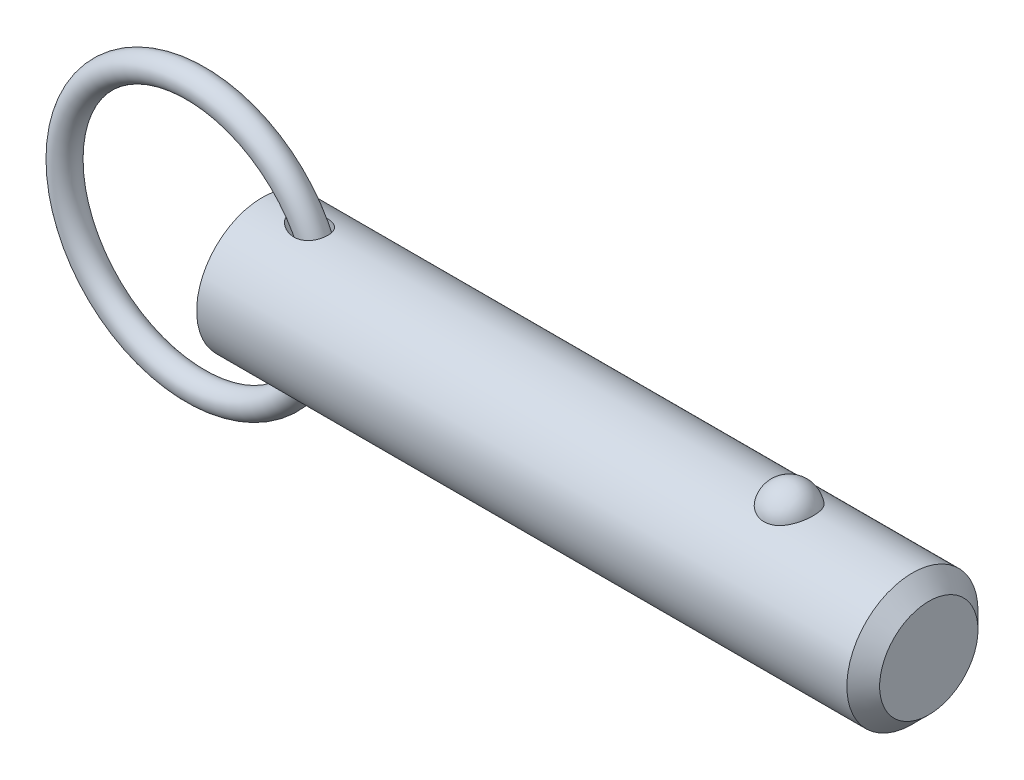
ISO-10303-21;
HEADER;
FILE_DESCRIPTION(('STEP AP214'),'2;1');
FILE_NAME('part.step','',(''),(''),'','','');
FILE_SCHEMA(('AUTOMOTIVE_DESIGN { 1 0 10303 214 1 1 1 1 }'));
ENDSEC;
DATA;
#1=APPLICATION_CONTEXT('core data for automotive mechanical design processes');
#2=APPLICATION_PROTOCOL_DEFINITION('international standard','automotive_design',2000,#1);
#3=PRODUCT_CONTEXT('',#1,'mechanical');
#4=PRODUCT('Part','Part','',(#3));
#5=PRODUCT_RELATED_PRODUCT_CATEGORY('part','',(#4));
#6=PRODUCT_DEFINITION_FORMATION('','',#4);
#7=PRODUCT_DEFINITION_CONTEXT('part definition',#1,'design');
#8=PRODUCT_DEFINITION('design','',#6,#7);
#9=PRODUCT_DEFINITION_SHAPE('','',#8);
#10=(LENGTH_UNIT() NAMED_UNIT(*) SI_UNIT(.MILLI.,.METRE.));
#11=(NAMED_UNIT(*) PLANE_ANGLE_UNIT() SI_UNIT($,.RADIAN.));
#12=(NAMED_UNIT(*) SI_UNIT($,.STERADIAN.) SOLID_ANGLE_UNIT());
#13=UNCERTAINTY_MEASURE_WITH_UNIT(LENGTH_MEASURE(1.E-05),#10,'distance_accuracy_value','');
#14=(GEOMETRIC_REPRESENTATION_CONTEXT(3) GLOBAL_UNCERTAINTY_ASSIGNED_CONTEXT((#13)) GLOBAL_UNIT_ASSIGNED_CONTEXT((#10,
#11,#12)) REPRESENTATION_CONTEXT('',''));
#15=CARTESIAN_POINT('',(0.,0.,0.));
#16=DIRECTION('',(0.,0.,1.));
#17=DIRECTION('',(1.,0.,0.));
#18=AXIS2_PLACEMENT_3D('',#15,#16,#17);
#19=CARTESIAN_POINT('',(-9.66825126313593,0.,0.));
#20=DIRECTION('',(0.,0.,1.));
#21=DIRECTION('',(1.,0.,0.));
#22=AXIS2_PLACEMENT_3D('',#19,#20,#21);
#23=TOROIDAL_SURFACE('',#22,19.05,1.905);
#24=CARTESIAN_POINT('',(11.2867487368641,0.,0.));
#25=VERTEX_POINT('',#24);
#26=VERTEX_LOOP('',#25);
#27=FACE_BOUND('',#26,.T.);
#28=ADVANCED_FACE('P0_F12',(#27),#23,.T.);
#29=CLOSED_SHELL('',(#28));
#30=MANIFOLD_SOLID_BREP('P0_B1',#29);
#31=CARTESIAN_POINT('',(0.,0.,0.));
#32=DIRECTION('',(1.,0.,0.));
#33=DIRECTION('',(0.,0.,-1.));
#34=AXIS2_PLACEMENT_3D('',#31,#32,#33);
#35=CYLINDRICAL_SURFACE('',#34,9.525);
#36=CARTESIAN_POINT('',(4.56693409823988,9.43141941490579,-1.33189820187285));
#37=CARTESIAN_POINT('',(4.70260475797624,9.41020313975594,-1.48215931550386));
#38=CARTESIAN_POINT('',(4.85555680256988,9.38755003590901,-1.61683982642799));
#39=CARTESIAN_POINT('',(5.10171959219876,9.35450554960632,-1.79512943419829));
#40=CARTESIAN_POINT('',(5.18674514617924,9.34362629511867,-1.85068909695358));
#41=CARTESIAN_POINT('',(5.36154389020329,9.32258514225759,-1.95392002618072));
#42=CARTESIAN_POINT('',(5.45131542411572,9.31242299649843,-2.00159402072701));
#43=CARTESIAN_POINT('',(5.70070211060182,9.28632120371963,-2.12033289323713));
#44=CARTESIAN_POINT('',(5.86420408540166,9.27146938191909,-2.18362944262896));
#45=CARTESIAN_POINT('',(6.19893345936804,9.24694163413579,-2.28525783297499));
#46=CARTESIAN_POINT('',(6.3701538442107,9.23726110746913,-2.32361187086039));
#47=CARTESIAN_POINT('',(6.73531776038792,9.22400982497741,-2.37575048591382));
#48=CARTESIAN_POINT('',(6.92975826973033,9.22118808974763,-2.38652934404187));
#49=CARTESIAN_POINT('',(7.21995443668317,9.22416297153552,-2.37494980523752));
#50=CARTESIAN_POINT('',(7.31643847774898,9.22635560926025,-2.366466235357));
#51=CARTESIAN_POINT('',(7.50796421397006,9.2331428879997,-2.33985028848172));
#52=CARTESIAN_POINT('',(7.60300650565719,9.23773650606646,-2.32172202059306));
#53=CARTESIAN_POINT('',(7.83273114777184,9.25183311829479,-2.26504721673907));
#54=CARTESIAN_POINT('',(7.96603028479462,9.26261470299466,-2.2209856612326));
#55=CARTESIAN_POINT('',(8.22310899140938,9.28816519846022,-2.1115730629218));
#56=CARTESIAN_POINT('',(8.34689477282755,9.30293147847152,-2.04623606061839));
#57=CARTESIAN_POINT('',(8.58136049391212,9.3349416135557,-1.89485344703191));
#58=CARTESIAN_POINT('',(8.69199721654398,9.35219324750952,-1.80874222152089));
#59=CARTESIAN_POINT('',(8.89592093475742,9.38707016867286,-1.61799188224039));
#60=CARTESIAN_POINT('',(8.98920771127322,9.40469546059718,-1.51335253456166));
#61=CARTESIAN_POINT('',(9.15057731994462,9.43713590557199,-1.29519427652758));
#62=CARTESIAN_POINT('',(9.21980158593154,9.45205440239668,-1.18253282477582));
#63=CARTESIAN_POINT('',(9.33826736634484,9.47856708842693,-0.946802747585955));
#64=CARTESIAN_POINT('',(9.38751161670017,9.49016173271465,-0.823735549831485));
#65=CARTESIAN_POINT('',(9.46423850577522,9.50859378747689,-0.57261402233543));
#66=CARTESIAN_POINT('',(9.4920239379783,9.5154972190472,-0.44465687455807));
#67=CARTESIAN_POINT('',(9.52636926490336,9.52406905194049,-0.185752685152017));
#68=CARTESIAN_POINT('',(9.5329292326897,9.52573747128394,-0.0548056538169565));
#69=CARTESIAN_POINT('',(9.52467276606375,9.52365852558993,0.20650329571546));
#70=CARTESIAN_POINT('',(9.50983454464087,9.51990564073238,0.336864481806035));
#71=CARTESIAN_POINT('',(9.45907362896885,9.50737852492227,0.593166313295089));
#72=CARTESIAN_POINT('',(9.42315106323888,9.49860432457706,0.719106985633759));
#73=CARTESIAN_POINT('',(9.33106648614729,9.4769892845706,0.962959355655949));
#74=CARTESIAN_POINT('',(9.27490839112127,9.46414923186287,1.08087260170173));
#75=CARTESIAN_POINT('',(9.1437580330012,9.43581000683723,1.30534632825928));
#76=CARTESIAN_POINT('',(9.06876720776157,9.42031103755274,1.41190767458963));
#77=CARTESIAN_POINT('',(8.90203187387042,9.38836719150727,1.61069439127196));
#78=CARTESIAN_POINT('',(8.81029913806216,9.37192298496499,1.70292975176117));
#79=CARTESIAN_POINT('',(8.61268775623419,9.33985045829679,1.87086859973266));
#80=CARTESIAN_POINT('',(8.50680947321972,9.3242221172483,1.94657251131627));
#81=CARTESIAN_POINT('',(8.28220546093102,9.29513431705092,2.08109032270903));
#82=CARTESIAN_POINT('',(8.16329919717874,9.28171415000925,2.13961034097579));
#83=CARTESIAN_POINT('',(7.9175605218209,9.25859072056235,2.23755716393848));
#84=CARTESIAN_POINT('',(7.79072606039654,9.24888842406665,2.27697900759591));
#85=CARTESIAN_POINT('',(7.52377913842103,9.23338749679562,2.33907806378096));
#86=CARTESIAN_POINT('',(7.38334767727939,9.22789571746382,2.36044900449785));
#87=CARTESIAN_POINT('',(7.10081394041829,9.22210229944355,2.3829751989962));
#88=CARTESIAN_POINT('',(6.95871103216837,9.22180269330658,2.38412253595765));
#89=CARTESIAN_POINT('',(6.65642691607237,9.22632724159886,2.36656230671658));
#90=CARTESIAN_POINT('',(6.49641694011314,9.23185415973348,2.3451317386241));
#91=CARTESIAN_POINT('',(6.18115433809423,9.24811737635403,2.28014143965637));
#92=CARTESIAN_POINT('',(6.02590710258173,9.25885936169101,2.23655754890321));
#93=CARTESIAN_POINT('',(5.6990472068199,9.28624254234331,2.12025087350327));
#94=CARTESIAN_POINT('',(5.52873601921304,9.30354853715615,2.04400672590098));
#95=CARTESIAN_POINT('',(5.20289495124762,9.34106989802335,1.86504730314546));
#96=CARTESIAN_POINT('',(5.04735968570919,9.36128419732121,1.76234172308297));
#97=CARTESIAN_POINT('',(4.79287124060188,9.39697639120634,1.55895334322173));
#98=CARTESIAN_POINT('',(4.6893870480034,9.41240250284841,1.46392900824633));
#99=CARTESIAN_POINT('',(4.49847141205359,9.44202586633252,1.25875918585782));
#100=CARTESIAN_POINT('',(4.41101129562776,9.45622528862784,1.1486413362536));
#101=CARTESIAN_POINT('',(4.27502257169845,9.47888210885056,0.940600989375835));
#102=CARTESIAN_POINT('',(4.22216329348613,9.48791121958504,0.845586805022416));
#103=CARTESIAN_POINT('',(4.13241478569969,9.50344321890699,0.648051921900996));
#104=CARTESIAN_POINT('',(4.09551182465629,9.50994827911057,0.545537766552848));
#105=CARTESIAN_POINT('',(4.04043124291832,9.51971586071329,0.334452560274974));
#106=CARTESIAN_POINT('',(4.0224072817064,9.52295176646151,0.225839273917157));
#107=CARTESIAN_POINT('',(4.00750873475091,9.52562364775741,0.00713006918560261));
#108=CARTESIAN_POINT('',(4.01062334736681,9.52506156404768,-0.102965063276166));
#109=CARTESIAN_POINT('',(4.03592967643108,9.52053221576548,-0.306944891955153));
#110=CARTESIAN_POINT('',(4.05571676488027,9.51699426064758,-0.401151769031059));
#111=CARTESIAN_POINT('',(4.10967975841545,9.5074546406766,-0.585176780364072));
#112=CARTESIAN_POINT('',(4.14385995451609,9.50145224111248,-0.674993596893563));
#113=CARTESIAN_POINT('',(4.23261356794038,9.48611703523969,-0.866116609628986));
#114=CARTESIAN_POINT('',(4.28990016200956,9.47635800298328,-0.966121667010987));
#115=CARTESIAN_POINT('',(4.4185657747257,9.45502867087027,-1.15640011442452));
#116=CARTESIAN_POINT('',(4.48996918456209,9.44345524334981,-1.24665623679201));
#117=CARTESIAN_POINT('',(4.56693409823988,9.43141941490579,-1.33189820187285));
#118=B_SPLINE_CURVE_WITH_KNOTS('',3,(#36,#37,#38,#39,#40,#41,#42,#43,#44,#45,#46,#47,#48,#49,
#50,#51,#52,#53,#54,#55,#56,#57,#58,#59,#60,#61,#62,#63,#64,#65,#66,#67,#68,#69,#70,#71,#72,#73,
#74,#75,#76,#77,#78,#79,#80,#81,#82,#83,#84,#85,#86,#87,#88,#89,#90,#91,#92,#93,#94,#95,#96,#97,
#98,#99,#100,#101,#102,#103,#104,#105,#106,#107,#108,#109,#110,#111,#112,#113,#114,#115,#116,
#117),.UNSPECIFIED.,.T.,.F.,(4,2,2,2,2,2,2,2,2,2,2,2,2,2,2,2,2,2,2,2,2,2,2,2,2,2,2,2,2,2,2,2,2,
2,2,2,2,2,2,2,4),(0.,0.609951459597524,0.916123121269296,1.22218863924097,1.74791337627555,
2.27316961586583,2.85362722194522,3.14383229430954,3.43391382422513,3.85437497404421,
4.27455920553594,4.69608835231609,5.11762282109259,5.5149005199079,5.91212379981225,
6.30363414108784,6.69514313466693,7.08705103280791,7.47895654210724,7.87078624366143,
8.26258603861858,8.65411137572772,9.04562666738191,9.44349251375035,9.84146165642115,
10.2662286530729,10.6911619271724,11.1739180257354,11.6572017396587,12.2170157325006,
12.7766249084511,13.1992556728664,13.6211226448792,13.9471990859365,14.2729943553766,
14.6014211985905,14.9296802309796,15.2173810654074,15.505167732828,15.8505863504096,
16.1966070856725),.UNSPECIFIED.);
#119=CARTESIAN_POINT('',(4.56693409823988,9.43141941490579,-1.33189820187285));
#120=VERTEX_POINT('',#119);
#121=EDGE_CURVE('P1_E40',#120,#120,#118,.T.);
#122=ORIENTED_EDGE('',*,*,#121,.T.);
#123=EDGE_LOOP('',(#122));
#124=FACE_BOUND('',#123,.T.);
#125=CARTESIAN_POINT('',(94.44875,0.,0.));
#126=DIRECTION('',(1.,0.,0.));
#127=DIRECTION('',(0.,0.,-1.));
#128=AXIS2_PLACEMENT_3D('',#125,#126,#127);
#129=CIRCLE('',#128,9.525);
#130=CARTESIAN_POINT('',(94.44875,0.,-9.525));
#131=VERTEX_POINT('',#130);
#132=EDGE_CURVE('P1_E25',#131,#131,#129,.T.);
#133=ORIENTED_EDGE('',*,*,#132,.F.);
#134=EDGE_LOOP('',(#133));
#135=FACE_BOUND('',#134,.T.);
#136=CARTESIAN_POINT('',(0.,0.,0.));
#137=DIRECTION('',(1.,0.,0.));
#138=DIRECTION('',(0.,0.,-1.));
#139=AXIS2_PLACEMENT_3D('',#136,#137,#138);
#140=CIRCLE('',#139,9.525);
#141=CARTESIAN_POINT('',(0.,0.,-9.525));
#142=VERTEX_POINT('',#141);
#143=EDGE_CURVE('P1_E9',#142,#142,#140,.T.);
#144=ORIENTED_EDGE('',*,*,#143,.T.);
#145=EDGE_LOOP('',(#144));
#146=FACE_BOUND('',#145,.T.);
#147=CARTESIAN_POINT('',(76.5457573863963,8.80405803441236,3.63513233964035));
#148=CARTESIAN_POINT('',(76.4516766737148,8.80405953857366,3.63513053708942));
#149=CARTESIAN_POINT('',(76.3575618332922,8.80561325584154,3.6313746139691));
#150=CARTESIAN_POINT('',(76.1700126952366,8.81177748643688,3.61638665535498));
#151=CARTESIAN_POINT('',(76.0765788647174,8.81638992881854,3.60514990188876));
#152=CARTESIAN_POINT('',(75.7979452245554,8.8346711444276,3.56024627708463));
#153=CARTESIAN_POINT('',(75.6146916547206,8.85278327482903,3.51538626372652));
#154=CARTESIAN_POINT('',(75.259509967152,8.89871214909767,3.39742145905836));
#155=CARTESIAN_POINT('',(75.0875533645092,8.9265032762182,3.32439116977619));
#156=CARTESIAN_POINT('',(74.758707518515,8.98874819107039,3.15220244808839));
#157=CARTESIAN_POINT('',(74.6018114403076,9.02319893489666,3.05305594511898));
#158=CARTESIAN_POINT('',(74.3022147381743,9.09629186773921,2.82797815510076));
#159=CARTESIAN_POINT('',(74.1600600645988,9.13502685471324,2.7013513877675));
#160=CARTESIAN_POINT('',(73.8982999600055,9.2118657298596,2.4264193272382));
#161=CARTESIAN_POINT('',(73.7787015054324,9.2499694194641,2.27810735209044));
#162=CARTESIAN_POINT('',(73.559645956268,9.3234108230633,1.95652290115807));
#163=CARTESIAN_POINT('',(73.4613174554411,9.35855090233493,1.78243511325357));
#164=CARTESIAN_POINT('',(73.2938190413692,9.42045142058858,1.41937246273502));
#165=CARTESIAN_POINT('',(73.2246511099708,9.44721128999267,1.23039658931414));
#166=CARTESIAN_POINT('',(73.1161994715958,9.48990641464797,0.840370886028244));
#167=CARTESIAN_POINT('',(73.0772880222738,9.50570658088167,0.639202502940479));
#168=CARTESIAN_POINT('',(73.0315550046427,9.52433146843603,0.232664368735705));
#169=CARTESIAN_POINT('',(73.0247324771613,9.52715657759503,0.0272947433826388));
#170=CARTESIAN_POINT('',(73.043255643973,9.51956918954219,-0.380478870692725));
#171=CARTESIAN_POINT('',(73.0684052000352,9.50923740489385,-0.58289331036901));
#172=CARTESIAN_POINT('',(73.1500253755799,9.47651897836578,-0.980293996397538));
#173=CARTESIAN_POINT('',(73.2064966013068,9.45413210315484,-1.17528009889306));
#174=CARTESIAN_POINT('',(73.3497192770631,9.39954044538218,-1.55263697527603));
#175=CARTESIAN_POINT('',(73.4365124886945,9.36732213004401,-1.73498993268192));
#176=CARTESIAN_POINT('',(73.6386103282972,9.29640700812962,-2.08177763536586));
#177=CARTESIAN_POINT('',(73.7539172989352,9.25770966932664,-2.24621090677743));
#178=CARTESIAN_POINT('',(74.011264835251,9.17775604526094,-2.5533833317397));
#179=CARTESIAN_POINT('',(74.1534344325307,9.136488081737,-2.696011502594));
#180=CARTESIAN_POINT('',(74.46089985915,9.05620497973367,-2.95451229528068));
#181=CARTESIAN_POINT('',(74.626193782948,9.01718965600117,-3.07038711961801));
#182=CARTESIAN_POINT('',(74.972052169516,8.9468001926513,-3.26976836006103));
#183=CARTESIAN_POINT('',(75.1522278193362,8.91528408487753,-3.35389750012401));
#184=CARTESIAN_POINT('',(75.5256514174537,8.86272514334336,-3.49043503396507));
#185=CARTESIAN_POINT('',(75.7188944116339,8.8416783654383,-3.54285537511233));
#186=CARTESIAN_POINT('',(76.1025036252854,8.81348056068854,-3.61241306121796));
#187=CARTESIAN_POINT('',(76.2925251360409,8.80568348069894,-3.63119339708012));
#188=CARTESIAN_POINT('',(76.6731906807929,8.80289410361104,-3.63795342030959));
#189=CARTESIAN_POINT('',(76.8638345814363,8.80789922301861,-3.62593932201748));
#190=CARTESIAN_POINT('',(77.234007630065,8.8297491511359,-3.57238430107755));
#191=CARTESIAN_POINT('',(77.4136976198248,8.84621463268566,-3.53178890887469));
#192=CARTESIAN_POINT('',(77.763422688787,8.88875330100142,-3.42331083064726));
#193=CARTESIAN_POINT('',(77.9334569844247,8.91482726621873,-3.35542593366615));
#194=CARTESIAN_POINT('',(78.2632377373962,8.97448239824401,-3.19248225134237));
#195=CARTESIAN_POINT('',(78.4226801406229,9.00821446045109,-3.09686474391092));
#196=CARTESIAN_POINT('',(78.7235136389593,9.07935398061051,-2.88162736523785));
#197=CARTESIAN_POINT('',(78.8649005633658,9.11676228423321,-2.76200196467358));
#198=CARTESIAN_POINT('',(79.1333193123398,9.19347419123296,-2.49516285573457));
#199=CARTESIAN_POINT('',(79.2592750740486,9.23277872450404,-2.34686614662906));
#200=CARTESIAN_POINT('',(79.4855227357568,9.30737610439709,-2.03093683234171));
#201=CARTESIAN_POINT('',(79.5858100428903,9.34266823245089,-1.86330077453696));
#202=CARTESIAN_POINT('',(79.7615149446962,9.40674710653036,-1.50744893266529));
#203=CARTESIAN_POINT('',(79.836041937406,9.4352917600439,-1.31874876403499));
#204=CARTESIAN_POINT('',(79.9541650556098,9.48144132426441,-0.930631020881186));
#205=CARTESIAN_POINT('',(79.9977608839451,9.49904612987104,-0.731213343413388));
#206=CARTESIAN_POINT('',(80.0531580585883,9.5215314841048,-0.327147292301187));
#207=CARTESIAN_POINT('',(80.0649354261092,9.52640243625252,-0.122495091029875));
#208=CARTESIAN_POINT('',(80.0563825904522,9.52289571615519,0.286018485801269));
#209=CARTESIAN_POINT('',(80.0360530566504,9.51451832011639,0.489879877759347));
#210=CARTESIAN_POINT('',(79.9638840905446,9.48544083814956,0.88999431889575));
#211=CARTESIAN_POINT('',(79.9121993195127,9.46480124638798,1.08627971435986));
#212=CARTESIAN_POINT('',(79.7784917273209,9.4133389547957,1.46682086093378));
#213=CARTESIAN_POINT('',(79.6964668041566,9.38251554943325,1.65107577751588));
#214=CARTESIAN_POINT('',(79.5031929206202,9.31365636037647,2.00346348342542));
#215=CARTESIAN_POINT('',(79.3917838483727,9.27558138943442,2.17150083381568));
#216=CARTESIAN_POINT('',(79.1422947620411,9.19638714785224,2.48563115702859));
#217=CARTESIAN_POINT('',(79.0042163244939,9.15526805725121,2.63172542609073));
#218=CARTESIAN_POINT('',(78.7048438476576,9.07465393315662,2.89750997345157));
#219=CARTESIAN_POINT('',(78.5436109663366,9.03515496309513,3.01726776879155));
#220=CARTESIAN_POINT('',(78.2016136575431,8.96227564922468,3.22732920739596));
#221=CARTESIAN_POINT('',(78.020841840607,8.92889763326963,3.31762165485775));
#222=CARTESIAN_POINT('',(77.6514451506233,8.8734538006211,3.46314419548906));
#223=CARTESIAN_POINT('',(77.4633237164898,8.85102983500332,3.51950082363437));
#224=CARTESIAN_POINT('',(77.1757869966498,8.8266696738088,3.57993683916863));
#225=CARTESIAN_POINT('',(77.0791339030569,8.82009725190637,3.59606217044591));
#226=CARTESIAN_POINT('',(76.8846770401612,8.81020897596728,3.62022512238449));
#227=CARTESIAN_POINT('',(76.7868741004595,8.80689090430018,3.62826825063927));
#228=CARTESIAN_POINT('',(76.6412243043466,8.80445615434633,3.63416760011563));
#229=CARTESIAN_POINT('',(76.5934952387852,8.80405727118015,3.63513325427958));
#230=CARTESIAN_POINT('',(76.5457573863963,8.80405803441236,3.63513233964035));
#231=B_SPLINE_CURVE_WITH_KNOTS('',3,(#147,#148,#149,#150,#151,#152,#153,#154,#155,#156,#157,
#158,#159,#160,#161,#162,#163,#164,#165,#166,#167,#168,#169,#170,#171,#172,#173,#174,#175,#176,
#177,#178,#179,#180,#181,#182,#183,#184,#185,#186,#187,#188,#189,#190,#191,#192,#193,#194,#195,
#196,#197,#198,#199,#200,#201,#202,#203,#204,#205,#206,#207,#208,#209,#210,#211,#212,#213,#214,
#215,#216,#217,#218,#219,#220,#221,#222,#223,#224,#225,#226,#227,#228,#229,#230),.UNSPECIFIED.,
.T.,.F.,(4,2,2,2,2,2,2,2,2,2,2,2,2,2,2,2,2,2,2,2,2,2,2,2,2,2,2,2,2,2,2,2,2,2,2,2,2,2,2,2,2,4),
(0.,0.282202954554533,0.564584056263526,1.13017050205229,1.69427128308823,2.258114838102,
2.83836627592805,3.41879688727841,4.02497117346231,4.63118665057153,5.24474754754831,
5.85829010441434,6.46808687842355,7.07789545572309,7.68854723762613,8.29924920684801,
8.91296283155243,9.52662591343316,10.1275338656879,10.7282152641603,11.2986646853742,
11.868998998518,12.4213015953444,12.973648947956,13.5380053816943,14.1024919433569,
14.695298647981,15.2882113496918,15.8999469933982,16.5116885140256,17.1238909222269,
17.7360805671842,18.3452748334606,18.9545113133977,19.567138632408,20.1797297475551,
20.7907316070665,21.4019653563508,21.9915938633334,22.2859053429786,22.5800161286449,
22.723209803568),.UNSPECIFIED.);
#232=CARTESIAN_POINT('',(76.5457573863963,8.80405803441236,3.63513233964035));
#233=VERTEX_POINT('',#232);
#234=EDGE_CURVE('P1_E34',#233,#233,#231,.T.);
#235=ORIENTED_EDGE('',*,*,#234,.T.);
#236=EDGE_LOOP('',(#235));
#237=FACE_BOUND('',#236,.T.);
#238=CARTESIAN_POINT('',(4.56693409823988,-9.43141941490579,-1.33189820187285));
#239=CARTESIAN_POINT('',(4.48932984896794,-9.4435553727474,-1.24594548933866));
#240=CARTESIAN_POINT('',(4.41737309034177,-9.45522193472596,-1.1548795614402));
#241=CARTESIAN_POINT('',(4.2878104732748,-9.47670896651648,-0.962782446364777));
#242=CARTESIAN_POINT('',(4.23019403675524,-9.48653079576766,-0.861758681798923));
#243=CARTESIAN_POINT('',(4.13254559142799,-9.5034118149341,-0.649723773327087));
#244=CARTESIAN_POINT('',(4.09271158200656,-9.51043980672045,-0.538615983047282));
#245=CARTESIAN_POINT('',(4.04973167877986,-9.51806966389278,-0.367764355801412));
#246=CARTESIAN_POINT('',(4.03820037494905,-9.52012756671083,-0.310118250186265));
#247=CARTESIAN_POINT('',(4.02100287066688,-9.52320274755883,-0.193935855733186));
#248=CARTESIAN_POINT('',(4.01533565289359,-9.52422020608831,-0.135399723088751));
#249=CARTESIAN_POINT('',(4.00817074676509,-9.52550497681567,0.0247266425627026));
#250=CARTESIAN_POINT('',(4.01270492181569,-9.52468821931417,0.126661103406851));
#251=CARTESIAN_POINT('',(4.03954973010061,-9.51988506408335,0.328012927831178));
#252=CARTESIAN_POINT('',(4.06186450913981,-9.51589792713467,0.42742969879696));
#253=CARTESIAN_POINT('',(4.12088980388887,-9.5054852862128,0.616362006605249));
#254=CARTESIAN_POINT('',(4.15684838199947,-9.49918763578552,0.706123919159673));
#255=CARTESIAN_POINT('',(4.24094647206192,-9.48470618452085,0.879522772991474));
#256=CARTESIAN_POINT('',(4.28909090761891,-9.47652162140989,0.96315722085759));
#257=CARTESIAN_POINT('',(4.42295891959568,-9.45426317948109,1.16513741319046));
#258=CARTESIAN_POINT('',(4.5152375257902,-9.43933320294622,1.27905352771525));
#259=CARTESIAN_POINT('',(4.71682295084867,-9.40825940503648,1.49055892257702));
#260=CARTESIAN_POINT('',(4.82617286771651,-9.39211256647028,1.58810554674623));
#261=CARTESIAN_POINT('',(5.09064226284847,-9.35555264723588,1.79246125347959));
#262=CARTESIAN_POINT('',(5.24990411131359,-9.33524115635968,1.89393122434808));
#263=CARTESIAN_POINT('',(5.58309255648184,-9.29785396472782,2.06968659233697));
#264=CARTESIAN_POINT('',(5.7570289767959,-9.28078045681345,2.14395359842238));
#265=CARTESIAN_POINT('',(6.11646882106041,-9.25213303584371,2.26440412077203));
#266=CARTESIAN_POINT('',(6.30205582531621,-9.2406056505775,2.31035092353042));
#267=CARTESIAN_POINT('',(6.67856093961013,-9.22541807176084,2.37029728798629));
#268=CARTESIAN_POINT('',(6.86947045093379,-9.2217458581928,2.3843456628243));
#269=CARTESIAN_POINT('',(7.21217144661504,-9.22344239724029,2.37775005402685));
#270=CARTESIAN_POINT('',(7.36409439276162,-9.22713860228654,2.36352577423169));
#271=CARTESIAN_POINT('',(7.66346227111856,-9.24048072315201,2.31082299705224));
#272=CARTESIAN_POINT('',(7.81090958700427,-9.25012341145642,2.27235765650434));
#273=CARTESIAN_POINT('',(8.09730316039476,-9.2746609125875,2.17003648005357));
#274=CARTESIAN_POINT('',(8.23619652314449,-9.28958517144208,2.10603803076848));
#275=CARTESIAN_POINT('',(8.49918675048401,-9.32290326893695,1.95324442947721));
#276=CARTESIAN_POINT('',(8.62328895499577,-9.34129584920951,1.86445826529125));
#277=CARTESIAN_POINT('',(8.84006515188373,-9.37706953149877,1.67466761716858));
#278=CARTESIAN_POINT('',(8.93465172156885,-9.39436331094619,1.57582357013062));
#279=CARTESIAN_POINT('',(9.1049023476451,-9.42761680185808,1.362809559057));
#280=CARTESIAN_POINT('',(9.18057146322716,-9.44357686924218,1.24864370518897));
#281=CARTESIAN_POINT('',(9.30789178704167,-9.47159985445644,1.01379272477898));
#282=CARTESIAN_POINT('',(9.36045544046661,-9.48380365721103,0.893617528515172));
#283=CARTESIAN_POINT('',(9.44498362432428,-9.50388751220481,0.645890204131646));
#284=CARTESIAN_POINT('',(9.47694947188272,-9.51176784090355,0.518338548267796));
#285=CARTESIAN_POINT('',(9.51944262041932,-9.52232073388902,0.260103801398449));
#286=CARTESIAN_POINT('',(9.53006646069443,-9.52501674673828,0.129437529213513));
#287=CARTESIAN_POINT('',(9.52993291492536,-9.52498309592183,-0.131885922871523));
#288=CARTESIAN_POINT('',(9.5191752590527,-9.52225336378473,-0.26254310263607));
#289=CARTESIAN_POINT('',(9.47648788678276,-9.51165418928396,-0.520312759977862));
#290=CARTESIAN_POINT('',(9.44453086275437,-9.50377811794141,-0.647420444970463));
#291=CARTESIAN_POINT('',(9.36015568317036,-9.48373425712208,-0.89429087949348));
#292=CARTESIAN_POINT('',(9.30773827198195,-9.47156662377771,-1.01405389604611));
#293=CARTESIAN_POINT('',(9.18380895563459,-9.44428888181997,-1.24269386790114));
#294=CARTESIAN_POINT('',(9.11232064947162,-9.42918241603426,-1.3515840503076));
#295=CARTESIAN_POINT('',(8.95212687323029,-9.39767706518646,-1.55562459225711));
#296=CARTESIAN_POINT('',(8.86342281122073,-9.3812782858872,-1.65077607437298));
#297=CARTESIAN_POINT('',(8.6710444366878,-9.34891827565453,-1.82517515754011));
#298=CARTESIAN_POINT('',(8.56732858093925,-9.33295841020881,-1.90437711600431));
#299=CARTESIAN_POINT('',(8.34818438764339,-9.30317889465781,-2.0449122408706));
#300=CARTESIAN_POINT('',(8.23275529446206,-9.28935938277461,-2.10624425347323));
#301=CARTESIAN_POINT('',(7.98961240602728,-9.26475003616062,-2.2120340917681));
#302=CARTESIAN_POINT('',(7.86162088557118,-9.25407358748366,-2.25587700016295));
#303=CARTESIAN_POINT('',(7.60027499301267,-9.23720810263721,-2.32397032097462));
#304=CARTESIAN_POINT('',(7.46691858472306,-9.23102078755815,-2.34821321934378));
#305=CARTESIAN_POINT('',(7.18516230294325,-9.22302718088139,-2.37943079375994));
#306=CARTESIAN_POINT('',(7.03654454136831,-9.22169704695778,-2.38452997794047));
#307=CARTESIAN_POINT('',(6.7401504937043,-9.22442327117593,-2.37395141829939));
#308=CARTESIAN_POINT('',(6.59237455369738,-9.22848170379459,-2.35826567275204));
#309=CARTESIAN_POINT('',(6.27762777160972,-9.2422287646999,-2.30385559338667));
#310=CARTESIAN_POINT('',(6.11124715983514,-9.25269504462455,-2.26192683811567));
#311=CARTESIAN_POINT('',(5.78635920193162,-9.27830776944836,-2.15445569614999));
#312=CARTESIAN_POINT('',(5.62786567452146,-9.29346211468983,-2.08887341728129));
#313=CARTESIAN_POINT('',(5.39013065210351,-9.31931237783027,-1.96924953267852));
#314=CARTESIAN_POINT('',(5.30683088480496,-9.32901725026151,-1.92292485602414));
#315=CARTESIAN_POINT('',(5.1445580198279,-9.34899035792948,-1.82334419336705));
#316=CARTESIAN_POINT('',(5.06558607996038,-9.35925874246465,-1.77008636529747));
#317=CARTESIAN_POINT('',(4.83670950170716,-9.39034445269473,-1.60010986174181));
#318=CARTESIAN_POINT('',(4.69422471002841,-9.41151337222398,-1.47288240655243));
#319=CARTESIAN_POINT('',(4.56693409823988,-9.43141941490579,-1.33189820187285));
#320=B_SPLINE_CURVE_WITH_KNOTS('',3,(#238,#239,#240,#241,#242,#243,#244,#245,#246,#247,#248,
#249,#250,#251,#252,#253,#254,#255,#256,#257,#258,#259,#260,#261,#262,#263,#264,#265,#266,#267,
#268,#269,#270,#271,#272,#273,#274,#275,#276,#277,#278,#279,#280,#281,#282,#283,#284,#285,#286,
#287,#288,#289,#290,#291,#292,#293,#294,#295,#296,#297,#298,#299,#300,#301,#302,#303,#304,#305,
#306,#307,#308,#309,#310,#311,#312,#313,#314,#315,#316,#317,#318,#319),.UNSPECIFIED.,.T.,.F.,(4,
2,2,2,2,2,2,2,2,2,2,2,2,2,2,2,2,2,2,2,2,2,2,2,2,2,2,2,2,2,2,2,2,2,2,2,2,2,2,2,4),(0.,
0.348900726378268,0.697543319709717,1.0499765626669,1.22617690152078,1.40234666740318,
1.70666745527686,2.01105922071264,2.30066493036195,2.59038784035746,3.03001384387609,
3.4707682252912,4.03766594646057,4.60494622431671,5.17690598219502,5.74798989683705,
6.20400848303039,6.65977977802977,7.11813321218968,7.57632066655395,7.98791759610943,
8.39940433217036,8.7927345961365,9.18603970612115,9.577561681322,9.9690885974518,
10.3611208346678,10.7531388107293,11.1446739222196,11.536177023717,11.9287850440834,
12.3214184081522,12.7268448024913,13.1324265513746,13.5768390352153,14.0214226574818,
14.5351685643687,15.0497849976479,15.3368801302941,15.6240516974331,16.1963372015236),.UNSPECIFIED.);
#321=CARTESIAN_POINT('',(4.56693409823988,-9.43141941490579,-1.33189820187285));
#322=VERTEX_POINT('',#321);
#323=EDGE_CURVE('P1_E17',#322,#322,#320,.T.);
#324=ORIENTED_EDGE('',*,*,#323,.T.);
#325=EDGE_LOOP('',(#324));
#326=FACE_BOUND('',#325,.T.);
#327=ADVANCED_FACE('P1_F13',(#124,#135,#146,#237,#326),#35,.T.);
#328=CARTESIAN_POINT('',(0.,0.,0.));
#329=DIRECTION('',(-1.,0.,0.));
#330=DIRECTION('',(0.,0.,1.));
#331=AXIS2_PLACEMENT_3D('',#328,#329,#330);
#332=PLANE('',#331);
#333=ORIENTED_EDGE('',*,*,#143,.F.);
#334=EDGE_LOOP('',(#333));
#335=FACE_BOUND('',#334,.T.);
#336=ADVANCED_FACE('P1_F15',(#335),#332,.T.);
#337=CARTESIAN_POINT('',(96.83,0.,0.));
#338=DIRECTION('',(-1.,0.,0.));
#339=DIRECTION('',(0.,0.,1.));
#340=AXIS2_PLACEMENT_3D('',#337,#338,#339);
#341=CONICAL_SURFACE('',#340,7.14375000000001,0.785398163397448);
#342=ORIENTED_EDGE('',*,*,#132,.T.);
#343=EDGE_LOOP('',(#342));
#344=FACE_BOUND('',#343,.T.);
#345=CARTESIAN_POINT('',(96.83,0.,0.));
#346=DIRECTION('',(1.,0.,0.));
#347=DIRECTION('',(0.,0.,-1.));
#348=AXIS2_PLACEMENT_3D('',#345,#346,#347);
#349=CIRCLE('',#348,7.14375000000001);
#350=CARTESIAN_POINT('',(96.83,0.,-7.14375000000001));
#351=VERTEX_POINT('',#350);
#352=EDGE_CURVE('P1_E30',#351,#351,#349,.T.);
#353=ORIENTED_EDGE('',*,*,#352,.F.);
#354=EDGE_LOOP('',(#353));
#355=FACE_BOUND('',#354,.T.);
#356=ADVANCED_FACE('P1_F55',(#344,#355),#341,.T.);
#357=CARTESIAN_POINT('',(96.83,7.14375000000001,0.));
#358=DIRECTION('',(1.,0.,0.));
#359=DIRECTION('',(0.,0.,-1.));
#360=AXIS2_PLACEMENT_3D('',#357,#358,#359);
#361=PLANE('',#360);
#362=ORIENTED_EDGE('',*,*,#352,.T.);
#363=EDGE_LOOP('',(#362));
#364=FACE_BOUND('',#363,.T.);
#365=ADVANCED_FACE('P1_F51',(#364),#361,.T.);
#366=CARTESIAN_POINT('',(76.5457573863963,8.57249999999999,0.));
#367=DIRECTION('',(-1.,0.,0.));
#368=DIRECTION('',(0.,1.,0.));
#369=AXIS2_PLACEMENT_3D('',#366,#367,#368);
#370=SPHERICAL_SURFACE('',#369,3.64250000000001);
#371=ORIENTED_EDGE('',*,*,#234,.F.);
#372=EDGE_LOOP('',(#371));
#373=FACE_BOUND('',#372,.T.);
#374=ADVANCED_FACE('P1_F46',(#373),#370,.T.);
#375=CARTESIAN_POINT('',(-9.66825126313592,0.,0.));
#376=DIRECTION('',(0.,0.,1.));
#377=DIRECTION('',(1.,0.,0.));
#378=AXIS2_PLACEMENT_3D('',#375,#376,#377);
#379=TOROIDAL_SURFACE('',#378,19.05,2.38125);
#380=ORIENTED_EDGE('',*,*,#323,.F.);
#381=EDGE_LOOP('',(#380));
#382=FACE_BOUND('',#381,.T.);
#383=ORIENTED_EDGE('',*,*,#121,.F.);
#384=EDGE_LOOP('',(#383));
#385=FACE_BOUND('',#384,.T.);
#386=ADVANCED_FACE('P1_F50',(#382,#385),#379,.F.);
#387=CLOSED_SHELL('',(#327,#336,#356,#365,#374,#386));
#388=MANIFOLD_SOLID_BREP('P1_B1',#387);
#389=ADVANCED_BREP_SHAPE_REPRESENTATION('',(#18,#30,#388),#14);
#390=SHAPE_DEFINITION_REPRESENTATION(#9,#389);
ENDSEC;
END-ISO-10303-21;
